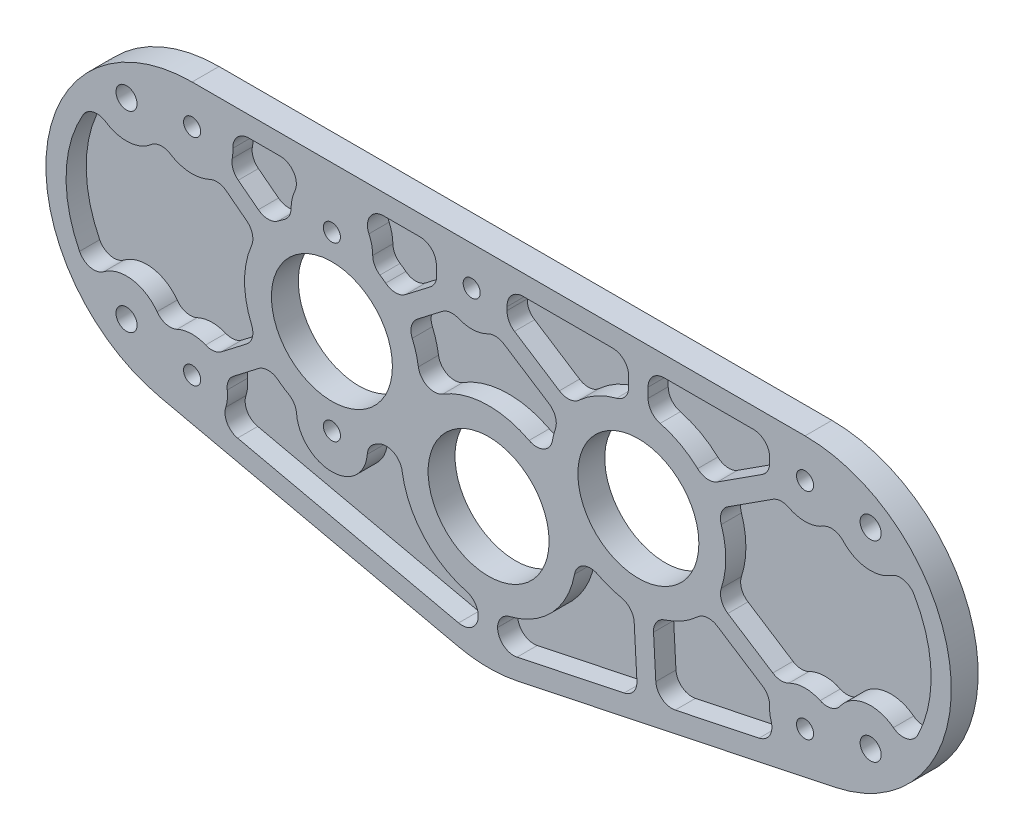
from build123d import *

# Parameters (mm, degrees)
SKETCH1_R           = 2.0193
SKETCH1_R_2         = 14.2875
BOSS_EXTRUDE1_DEPTH = 6.35
SKETCH2_R           = 2.4892
CUT_EXTRUDE1_DEPTH  = 118.748263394
BOSS_EXTRUDE2_START = -6.35
BOSS_EXTRUDE2_DEPTH = 6.35
CUT_EXTRUDE3_DEPTH  = 4.7625
FILLET3_R           = 3.81


with BuildPart() as part:
    # Sketch1 → Boss-Extrude1 (new body)
    with BuildSketch(Plane.XY):
        with BuildLine():
            Line((-70.030981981, 49.276), (74.749018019, 49.276))
            ThreePointArc((74.749018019, 49.276), (106.58139789, 20.581925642), (81.333370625, -14.047360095))
            Line((81.333370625, -14.047360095), (6.270812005, -29.827961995))
            ThreePointArc((6.270812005, -29.827961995), (-0.205168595, -30.479309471), (-6.671793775, -29.740840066))
            Line((-6.671793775, -29.740840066), (-77.036365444, -13.955882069))
            ThreePointArc((-77.036365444, -13.955882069), (-101.840360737, 20.796122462), (-70.030981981, 49.276))
        make_face()
        with Locations((-70.030981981, 42.672)):
            Circle(SKETCH1_R, mode=Mode.SUBTRACT)
        with Locations((-3.990981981, 42.672)):
            Circle(SKETCH1_R, mode=Mode.SUBTRACT)
        with Locations((74.749018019, 42.672)):
            Circle(SKETCH1_R, mode=Mode.SUBTRACT)
        with Locations((74.749018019, -8.128)):
            Circle(SKETCH1_R, mode=Mode.SUBTRACT)
        with Locations((-70.030981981, -8.128)):
            Circle(SKETCH1_R, mode=Mode.SUBTRACT)
        with Locations((-37.010981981, 17.272)):
            Circle(SKETCH1_R_2, mode=Mode.SUBTRACT)
        with Locations((35.379018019, 17.272)):
            Circle(SKETCH1_R_2, mode=Mode.SUBTRACT)
        Circle(SKETCH1_R_2, mode=Mode.SUBTRACT)
        with Locations((-37.010981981, 37.592)):
            Circle(SKETCH1_R, mode=Mode.SUBTRACT)
        with Locations((-37.010981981, -3.048)):
            Circle(SKETCH1_R, mode=Mode.SUBTRACT)
    extrude(amount=BOSS_EXTRUDE1_DEPTH)

    # Sketch2 → Cut-Extrude1 (cut, through all)
    with BuildSketch(Plane(origin=(0, 0, 0), x_dir=(-1, 0, 0), z_dir=(0, 0, -1))):
        with Locations((85.524981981, 40.826990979)):
            Circle(SKETCH2_R)
        with Locations((85.524981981, -4.449014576)):
            Circle(SKETCH2_R)
        with Locations((-90.243018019, -4.449014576)):
            Circle(SKETCH2_R)
        with Locations((-90.243018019, 40.826990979)):
            Circle(SKETCH2_R)
    extrude(amount=-CUT_EXTRUDE1_DEPTH, mode=Mode.SUBTRACT)

    # Sketch5 → Boss-Extrude2 (add)
    with BuildSketch(Plane.XY.offset(6.35).offset(BOSS_EXTRUDE2_START)):
        with BuildLine():
            Line((-77.592348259, -16.434285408), (-7.227776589, -32.219243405))
            ThreePointArc((-7.227776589, -32.219243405), (-0.222265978, -33.019251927), (6.793379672, -32.313625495))
            Line((6.793379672, -32.313625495), (81.855938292, -16.533023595))
            ThreePointArc((81.855938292, -16.533023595), (109.107777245, 20.844618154), (74.749018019, 51.816))
            Line((74.749018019, 51.816), (-70.030981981, 51.816))
            ThreePointArc((-70.030981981, 51.816), (-104.364914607, 21.075814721), (-77.592348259, -16.434285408))
        make_face()
        with BuildLine():
            Line((74.749018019, 49.276), (-70.030981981, 49.276))
            ThreePointArc((-70.030981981, 49.276), (-101.840360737, 20.796122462), (-77.036365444, -13.955882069))
            Line((-77.036365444, -13.955882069), (-6.671793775, -29.740840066))
            ThreePointArc((-6.671793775, -29.740840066), (-0.205168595, -30.479309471), (6.270812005, -29.827961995))
            Line((6.270812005, -29.827961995), (81.333370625, -14.047360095))
            ThreePointArc((81.333370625, -14.047360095), (106.58139789, 20.581925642), (74.749018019, 49.276))
        make_face(mode=Mode.SUBTRACT)
    extrude(amount=BOSS_EXTRUDE2_DEPTH)

    # Sketch6 → Cut-Extrude3 (cut)
    with BuildSketch(Plane.XY.offset(6.35)):
        with BuildLine():
            ThreePointArc((20.40834764, 3.066879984), (16.32008328, -12.631757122), (2.147886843, -20.525422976))
            Line((2.147886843, -20.525422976), (2.096363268, -28.179630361))
            ThreePointArc((2.096363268, -28.179630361), (3.963719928, -27.978120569), (5.813565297, -27.653006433))
            Line((5.813565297, -27.653006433), (35.239735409, -21.466664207))
            ThreePointArc((35.239735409, -21.466664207), (35.210416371, -21.294939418), (35.194259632, -21.121480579))
            Line((35.194259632, -21.121480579), (34.219114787, -3.332878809))
            ThreePointArc((34.219114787, -3.332878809), (26.70214765, -1.452805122), (20.40834764, 3.066879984))
        make_face()
        with BuildLine():
            Line((-2.475533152, -28.148855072), (-2.424009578, -20.494647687))
            ThreePointArc((-2.424009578, -20.494647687), (-17.255273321, -11.320863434), (-19.76515665, 5.936749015))
            ThreePointArc((-19.76515665, 5.936749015), (-23.711071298, 1.49167104), (-28.760214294, -1.64442775))
            ThreePointArc((-28.760214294, -1.64442775), (-37.010981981, -11.4173), (-45.261749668, -1.64442775))
            ThreePointArc((-45.261749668, -1.64442775), (-48.794570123, 0.329348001), (-51.87429751, 2.954589))
            Line((-51.87429751, 2.954589), (-62.255728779, -5.031127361))
            ThreePointArc((-62.255728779, -5.031127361), (-61.903100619, -10.123677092), (-64.57423016, -14.473789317))
            Line((-64.57423016, -14.473789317), (-6.185308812, -27.572237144))
            ThreePointArc((-6.185308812, -27.572237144), (-4.340007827, -27.922224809), (-2.475533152, -28.148855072))
        make_face()
        with BuildLine():
            ThreePointArc((-19.360068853, 27.965534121), (-16.538264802, 19.874740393), (-17.245825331, 11.335250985))
            ThreePointArc((-17.245825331, 11.335250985), (-1.831152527, 20.55610096), (14.970670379, 14.205120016))
            ThreePointArc((14.970670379, 14.205120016), (14.993425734, 20.486659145), (16.904811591, 26.470375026))
            Line((16.904811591, 26.470375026), (1.534985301, 36.386391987))
            ThreePointArc((1.534985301, 36.386391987), (-3.644886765, 34.30985909), (-8.978637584, 35.951250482))
            Line((-8.978637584, 35.951250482), (-19.360068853, 27.965534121))
        make_face()
        with BuildLine():
            Line((38.784260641, -3.082624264), (39.740180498, -20.520523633))
            Line((39.740180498, -20.520523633), (69.14009982, -14.33970018))
            ThreePointArc((69.14009982, -14.33970018), (66.682973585, -10.360511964), (66.744446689, -5.684228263))
            Line((66.744446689, -5.684228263), (51.374620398, 4.231788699))
            ThreePointArc((51.374620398, 4.231788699), (45.745953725, -0.572692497), (38.784260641, -3.082624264))
        make_face()
        with BuildLine():
            Line((4.01358935, 40.228228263), (19.38341564, 30.312211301))
            ThreePointArc((19.38341564, 30.312211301), (25.504528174, 35.393833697), (33.093018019, 37.7825))
            Line((33.093018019, 37.7825), (33.093018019, 47.0535))
            Line((33.093018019, 47.0535), (3.139771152, 47.0535))
            ThreePointArc((3.139771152, 47.0535), (4.310559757, 43.73482043), (4.01358935, 40.228228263))
        make_face()
        with BuildLine():
            Line((-65.043326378, -1.407250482), (-54.661895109, 6.578465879))
            ThreePointArc((-54.661895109, 6.578465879), (-57.648481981, 17.272), (-54.661895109, 27.965534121))
            Line((-54.661895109, 27.965534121), (-64.002403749, 35.150540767))
            ThreePointArc((-64.002403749, 35.150540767), (-71.176227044, 33.100975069), (-77.663953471, 36.785247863))
            ThreePointArc((-77.663953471, 36.785247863), (-85.175830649, 31.994689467), (-93.042428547, 36.177318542))
            ThreePointArc((-93.042428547, 36.177318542), (-99.808840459, 17.73771098), (-93.622369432, -0.904473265))
            ThreePointArc((-93.622369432, -0.904473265), (-84.343745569, 4.310901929), (-76.777950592, -3.175869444))
            ThreePointArc((-76.777950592, -3.175869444), (-71.27829863, 0.147831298), (-65.043326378, -1.407250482))
        make_face()
        with BuildLine():
            ThreePointArc((-27.57437202, 35.625659), (-24.694553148, 33.831347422), (-22.147666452, 31.589411))
            Line((-22.147666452, 31.589411), (-11.766235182, 39.575127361))
            ThreePointArc((-11.766235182, 39.575127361), (-12.329373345, 43.390618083), (-11.121735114, 47.0535))
            Line((-11.121735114, 47.0535), (-35.168124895, 47.0535))
            ThreePointArc((-35.168124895, 47.0535), (-28.982564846, 42.926849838), (-27.57437202, 35.625659))
        make_face()
        with BuildLine():
            ThreePointArc((53.853224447, 26.470375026), (56.016518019, 17.272), (53.853224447, 8.073624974))
            Line((53.853224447, 8.073624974), (69.223050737, -1.842391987))
            ThreePointArc((69.223050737, -1.842391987), (75.653037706, 0.192332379), (81.495986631, -3.175869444))
            ThreePointArc((81.495986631, -3.175869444), (89.061781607, 4.310901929), (98.340405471, -0.904473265))
            ThreePointArc((98.340405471, -0.904473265), (104.526876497, 17.73771098), (97.760464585, 36.177318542))
            ThreePointArc((97.760464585, 36.177318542), (89.142552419, 32.056561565), (81.809864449, 38.178712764))
            ThreePointArc((81.809864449, 38.178712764), (75.928876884, 34.386282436), (69.223050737, 36.386391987))
            Line((69.223050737, 36.386391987), (53.853224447, 26.470375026))
        make_face()
        with BuildLine():
            Line((37.665018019, 47.0535), (37.665018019, 37.7825))
            ThreePointArc((37.665018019, 37.7825), (45.253507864, 35.393833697), (51.374620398, 30.312211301))
            Line((51.374620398, 30.312211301), (66.744446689, 40.228228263))
            ThreePointArc((66.744446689, 40.228228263), (66.447476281, 43.73482043), (67.618264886, 47.0535))
            Line((67.618264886, 47.0535), (37.665018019, 47.0535))
        make_face()
        with BuildLine():
            Line((-61.21480615, 38.774417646), (-51.87429751, 31.589411))
            ThreePointArc((-51.87429751, 31.589411), (-49.327410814, 33.831347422), (-46.447591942, 35.625659))
            ThreePointArc((-46.447591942, 35.625659), (-45.039399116, 42.926849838), (-38.853839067, 47.0535))
            Line((-38.853839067, 47.0535), (-61.445030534, 47.0535))
            ThreePointArc((-61.445030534, 47.0535), (-60.395406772, 42.939945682), (-61.21480615, 38.774417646))
        make_face()
    extrude(amount=-CUT_EXTRUDE3_DEPTH, mode=Mode.SUBTRACT)

    # Fillet3
    fillet3_edges = [part.edges().sort_by_distance(p)[0] for p in [
        (67.618264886, 47.0535, 3.96875),
        (37.665018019, 47.0535, 3.96875),
        (37.665018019, 37.7825, 3.96875),
        (51.374620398, 30.312211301, 3.96875),
        (66.744446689, 40.228228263, 3.96875),
        (-27.57437202, 35.625659, 3.96875),
        (-22.147666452, 31.589411, 3.96875),
        (-11.766235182, 39.575127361, 3.96875),
        (-11.121735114, 47.0535, 3.96875),
        (-35.168124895, 47.0535, 3.96875),
        (-62.255728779, -5.031127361, 3.96875),
        (-64.57423016, -14.473789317, 3.96875),
        (-2.475533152, -28.148855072, 3.96875),
        (-2.424009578, -20.494647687, 3.96875),
        (-19.76515665, 5.936749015, 3.96875),
        (-28.760214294, -1.64442775, 3.96875),
        (-45.261749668, -1.64442775, 3.96875),
        (69.223050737, 36.386391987, 3.96875),
        (53.853224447, 26.470375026, 3.96875),
        (53.853224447, 8.073624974, 3.96875),
        (69.223050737, -1.842391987, 3.96875),
        (81.495986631, -3.175869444, 3.96875),
        (98.340405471, -0.904473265, 3.96875),
        (97.760464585, 36.177318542, 3.96875),
        (81.809864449, 38.178712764, 3.96875),
        (2.147886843, -20.525422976, 3.96875),
        (2.096363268, -28.179630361, 3.96875),
        (35.239735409, -21.466664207, 3.96875),
        (34.219114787, -3.332878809, 3.96875),
        (20.40834764, 3.066879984, 3.96875),
        (-54.661895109, 27.965534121, 3.96875),
        (-64.002403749, 35.150540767, 3.96875),
        (-77.663953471, 36.785247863, 3.96875),
        (-93.042428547, 36.177318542, 3.96875),
        (-93.622369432, -0.904473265, 3.96875),
        (-76.777950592, -3.175869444, 3.96875),
        (-65.043326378, -1.407250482, 3.96875),
        (-54.661895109, 6.578465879, 3.96875),
        (66.744446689, -5.684228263, 3.96875),
        (51.374620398, 4.231788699, 3.96875),
        (38.784260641, -3.082624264, 3.96875),
        (39.740180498, -20.520523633, 3.96875),
        (69.14009982, -14.33970018, 3.96875),
        (14.970670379, 14.205120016, 3.96875),
        (16.904811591, 26.470375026, 3.96875),
        (1.534985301, 36.386391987, 3.96875),
        (-8.978637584, 35.951250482, 3.96875),
        (-19.360068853, 27.965534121, 3.96875),
        (-17.245825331, 11.335250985, 3.96875),
        (-46.447591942, 35.625659, 3.96875),
        (-38.853839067, 47.0535, 3.96875),
        (-61.445030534, 47.0535, 3.96875),
        (-61.21480615, 38.774417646, 3.96875),
        (-51.87429751, 31.589411, 3.96875),
        (33.093018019, 37.7825, 3.96875),
        (33.093018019, 47.0535, 3.96875),
        (3.139771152, 47.0535, 3.96875),
        (4.01358935, 40.228228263, 3.96875),
        (19.38341564, 30.312211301, 3.96875),
        (-51.87429751, 2.954589, 3.96875),
    ]]
    fillet(fillet3_edges, radius=FILLET3_R)


solid = part.part
